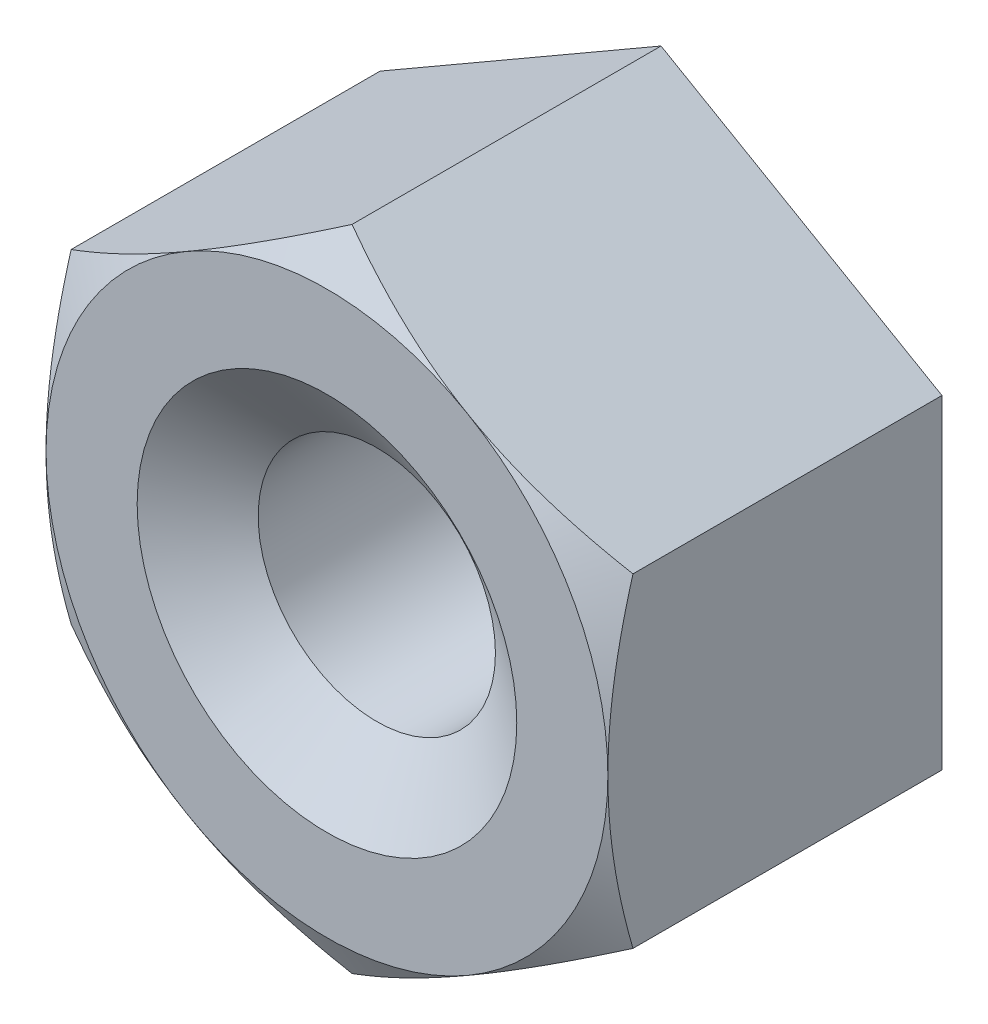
ISO-10303-21;
HEADER;
FILE_DESCRIPTION(('STEP AP214'),'2;1');
FILE_NAME('part.step','',(''),(''),'','','');
FILE_SCHEMA(('AUTOMOTIVE_DESIGN { 1 0 10303 214 1 1 1 1 }'));
ENDSEC;
DATA;
#1=APPLICATION_CONTEXT('core data for automotive mechanical design processes');
#2=APPLICATION_PROTOCOL_DEFINITION('international standard','automotive_design',2000,#1);
#3=PRODUCT_CONTEXT('',#1,'mechanical');
#4=PRODUCT('Part','Part','',(#3));
#5=PRODUCT_RELATED_PRODUCT_CATEGORY('part','',(#4));
#6=PRODUCT_DEFINITION_FORMATION('','',#4);
#7=PRODUCT_DEFINITION_CONTEXT('part definition',#1,'design');
#8=PRODUCT_DEFINITION('design','',#6,#7);
#9=PRODUCT_DEFINITION_SHAPE('','',#8);
#10=(LENGTH_UNIT() NAMED_UNIT(*) SI_UNIT(.MILLI.,.METRE.));
#11=(NAMED_UNIT(*) PLANE_ANGLE_UNIT() SI_UNIT($,.RADIAN.));
#12=(NAMED_UNIT(*) SI_UNIT($,.STERADIAN.) SOLID_ANGLE_UNIT());
#13=UNCERTAINTY_MEASURE_WITH_UNIT(LENGTH_MEASURE(1.E-05),#10,'distance_accuracy_value','');
#14=(GEOMETRIC_REPRESENTATION_CONTEXT(3) GLOBAL_UNCERTAINTY_ASSIGNED_CONTEXT((#13)) GLOBAL_UNIT_ASSIGNED_CONTEXT((#10,
#11,#12)) REPRESENTATION_CONTEXT('',''));
#15=CARTESIAN_POINT('',(0.,0.,0.));
#16=DIRECTION('',(0.,0.,1.));
#17=DIRECTION('',(1.,0.,0.));
#18=AXIS2_PLACEMENT_3D('',#15,#16,#17);
#19=CARTESIAN_POINT('',(0.,0.,-11.176));
#20=DIRECTION('',(0.,0.,1.));
#21=DIRECTION('',(1.,0.,0.));
#22=AXIS2_PLACEMENT_3D('',#19,#20,#21);
#23=CYLINDRICAL_SURFACE('',#22,3.96875);
#24=CARTESIAN_POINT('',(0.,0.,-1.66736920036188));
#25=DIRECTION('',(0.,0.,1.));
#26=DIRECTION('',(1.,0.,0.));
#27=AXIS2_PLACEMENT_3D('',#24,#25,#26);
#28=CIRCLE('',#27,3.96875);
#29=CARTESIAN_POINT('',(3.96875,0.,-1.66736920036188));
#30=VERTEX_POINT('',#29);
#31=EDGE_CURVE('E130',#30,#30,#28,.F.);
#32=ORIENTED_EDGE('',*,*,#31,.F.);
#33=EDGE_LOOP('',(#32));
#34=FACE_BOUND('',#33,.T.);
#35=CARTESIAN_POINT('',(0.,0.,-9.48323079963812));
#36=DIRECTION('',(0.,0.,-1.));
#37=DIRECTION('',(-1.,0.,0.));
#38=AXIS2_PLACEMENT_3D('',#35,#36,#37);
#39=CIRCLE('',#38,3.96875);
#40=CARTESIAN_POINT('',(-3.96875,0.,-9.48323079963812));
#41=VERTEX_POINT('',#40);
#42=EDGE_CURVE('E36',#41,#41,#39,.F.);
#43=ORIENTED_EDGE('',*,*,#42,.F.);
#44=EDGE_LOOP('',(#43));
#45=FACE_BOUND('',#44,.T.);
#46=ADVANCED_FACE('F31',(#34,#45),#23,.F.);
#47=CARTESIAN_POINT('',(-18.796,0.,-11.176));
#48=DIRECTION('',(0.,0.,1.));
#49=DIRECTION('',(1.,0.,0.));
#50=AXIS2_PLACEMENT_3D('',#47,#48,#49);
#51=PLANE('',#50);
#52=DIRECTION('',(-0.866025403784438,-0.500000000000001,0.));
#53=VECTOR('',#52,1.);
#54=CARTESIAN_POINT('',(0.,10.8518756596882,-11.176));
#55=LINE('',#54,#53);
#56=CARTESIAN_POINT('',(0.,10.8518756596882,-11.176));
#57=VERTEX_POINT('',#56);
#58=CARTESIAN_POINT('',(-9.398,5.4259378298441,-11.176));
#59=VERTEX_POINT('',#58);
#60=EDGE_CURVE('E254',#57,#59,#55,.T.);
#61=ORIENTED_EDGE('',*,*,#60,.F.);
#62=DIRECTION('',(-0.866025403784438,0.500000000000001,0.));
#63=VECTOR('',#62,1.);
#64=CARTESIAN_POINT('',(9.398,5.4259378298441,-11.176));
#65=LINE('',#64,#63);
#66=CARTESIAN_POINT('',(9.398,5.4259378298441,-11.176));
#67=VERTEX_POINT('',#66);
#68=EDGE_CURVE('E230',#67,#57,#65,.T.);
#69=ORIENTED_EDGE('',*,*,#68,.F.);
#70=DIRECTION('',(0.,-1.,0.));
#71=VECTOR('',#70,1.);
#72=CARTESIAN_POINT('',(9.398,5.4259378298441,-11.176));
#73=LINE('',#72,#71);
#74=CARTESIAN_POINT('',(9.398,-5.42593782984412,-11.176));
#75=VERTEX_POINT('',#74);
#76=EDGE_CURVE('E243',#67,#75,#73,.T.);
#77=ORIENTED_EDGE('',*,*,#76,.T.);
#78=DIRECTION('',(0.866025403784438,0.500000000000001,0.));
#79=VECTOR('',#78,1.);
#80=CARTESIAN_POINT('',(0.,-10.8518756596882,-11.176));
#81=LINE('',#80,#79);
#82=CARTESIAN_POINT('',(0.,-10.8518756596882,-11.176));
#83=VERTEX_POINT('',#82);
#84=EDGE_CURVE('E245',#83,#75,#81,.T.);
#85=ORIENTED_EDGE('',*,*,#84,.F.);
#86=DIRECTION('',(0.866025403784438,-0.500000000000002,0.));
#87=VECTOR('',#86,1.);
#88=CARTESIAN_POINT('',(-9.398,-5.42593782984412,-11.176));
#89=LINE('',#88,#87);
#90=CARTESIAN_POINT('',(-9.398,-5.42593782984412,-11.176));
#91=VERTEX_POINT('',#90);
#92=EDGE_CURVE('E248',#91,#83,#89,.T.);
#93=ORIENTED_EDGE('',*,*,#92,.F.);
#94=DIRECTION('',(0.,-1.,0.));
#95=VECTOR('',#94,1.);
#96=CARTESIAN_POINT('',(-9.398,5.4259378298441,-11.176));
#97=LINE('',#96,#95);
#98=EDGE_CURVE('E251',#59,#91,#97,.T.);
#99=ORIENTED_EDGE('',*,*,#98,.F.);
#100=EDGE_LOOP('',(#61,#69,#77,#85,#93,#99));
#101=FACE_BOUND('',#100,.T.);
#102=CARTESIAN_POINT('',(0.,0.,-11.176));
#103=DIRECTION('',(0.,0.,1.));
#104=DIRECTION('',(1.,0.,0.));
#105=AXIS2_PLACEMENT_3D('',#102,#103,#104);
#106=CIRCLE('',#105,6.35);
#107=CARTESIAN_POINT('',(6.35,0.,-11.176));
#108=VERTEX_POINT('',#107);
#109=EDGE_CURVE('E215',#108,#108,#106,.F.);
#110=ORIENTED_EDGE('',*,*,#109,.F.);
#111=EDGE_LOOP('',(#110));
#112=FACE_BOUND('',#111,.T.);
#113=ADVANCED_FACE('F201',(#101,#112),#51,.F.);
#114=CARTESIAN_POINT('',(-18.796,0.,0.));
#115=DIRECTION('',(0.,0.,1.));
#116=DIRECTION('',(1.,0.,0.));
#117=AXIS2_PLACEMENT_3D('',#114,#115,#116);
#118=PLANE('',#117);
#119=CARTESIAN_POINT('',(0.,0.,0.));
#120=DIRECTION('',(0.,0.,1.));
#121=DIRECTION('',(1.,0.,0.));
#122=AXIS2_PLACEMENT_3D('',#119,#120,#121);
#123=CIRCLE('',#122,9.398);
#124=CARTESIAN_POINT('',(9.398,0.,0.));
#125=VERTEX_POINT('',#124);
#126=CARTESIAN_POINT('',(4.69900000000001,-8.13890674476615,0.));
#127=VERTEX_POINT('',#126);
#128=EDGE_CURVE('E11',#125,#127,#123,.F.);
#129=ORIENTED_EDGE('',*,*,#128,.F.);
#130=CARTESIAN_POINT('',(0.,0.,0.));
#131=DIRECTION('',(0.,0.,1.));
#132=DIRECTION('',(1.,0.,0.));
#133=AXIS2_PLACEMENT_3D('',#130,#131,#132);
#134=CIRCLE('',#133,9.398);
#135=CARTESIAN_POINT('',(4.69900000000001,8.13890674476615,0.));
#136=VERTEX_POINT('',#135);
#137=EDGE_CURVE('E122',#125,#136,#134,.T.);
#138=ORIENTED_EDGE('',*,*,#137,.T.);
#139=CARTESIAN_POINT('',(-4.69900000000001,8.13890674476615,0.));
#140=VERTEX_POINT('',#139);
#141=EDGE_CURVE('E43',#140,#136,#123,.F.);
#142=ORIENTED_EDGE('',*,*,#141,.F.);
#143=CARTESIAN_POINT('',(-9.398,0.,0.));
#144=VERTEX_POINT('',#143);
#145=EDGE_CURVE('E282',#144,#140,#123,.F.);
#146=ORIENTED_EDGE('',*,*,#145,.F.);
#147=CARTESIAN_POINT('',(-4.69900000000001,-8.13890674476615,0.));
#148=VERTEX_POINT('',#147);
#149=EDGE_CURVE('E280',#148,#144,#123,.F.);
#150=ORIENTED_EDGE('',*,*,#149,.F.);
#151=EDGE_CURVE('E41',#127,#148,#123,.F.);
#152=ORIENTED_EDGE('',*,*,#151,.F.);
#153=EDGE_LOOP('',(#129,#138,#142,#146,#150,#152));
#154=FACE_BOUND('',#153,.T.);
#155=CARTESIAN_POINT('',(0.,0.,0.));
#156=DIRECTION('',(0.,0.,1.));
#157=DIRECTION('',(1.,0.,0.));
#158=AXIS2_PLACEMENT_3D('',#155,#156,#157);
#159=CIRCLE('',#158,6.35);
#160=CARTESIAN_POINT('',(6.35,0.,0.));
#161=VERTEX_POINT('',#160);
#162=EDGE_CURVE('E214',#161,#161,#159,.T.);
#163=ORIENTED_EDGE('',*,*,#162,.F.);
#164=EDGE_LOOP('',(#163));
#165=FACE_BOUND('',#164,.T.);
#166=ADVANCED_FACE('F132',(#154,#165),#118,.T.);
#167=CARTESIAN_POINT('',(0.,10.8518756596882,-11.176));
#168=DIRECTION('',(-0.500000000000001,0.866025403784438,0.));
#169=DIRECTION('',(-0.866025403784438,-0.500000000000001,0.));
#170=AXIS2_PLACEMENT_3D('',#167,#168,#169);
#171=PLANE('',#170);
#172=DIRECTION('',(0.,0.,1.));
#173=VECTOR('',#172,1.);
#174=CARTESIAN_POINT('',(-9.398,5.4259378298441,-11.176));
#175=LINE('',#174,#173);
#176=CARTESIAN_POINT('',(-9.398,5.4259378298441,-0.839395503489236));
#177=VERTEX_POINT('',#176);
#178=EDGE_CURVE('E226',#59,#177,#175,.T.);
#179=ORIENTED_EDGE('',*,*,#178,.T.);
#180=CARTESIAN_POINT('',(-9.3982,5.42582235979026,-0.839462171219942));
#181=CARTESIAN_POINT('',(-9.19161139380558,5.54509634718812,-0.770610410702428));
#182=CARTESIAN_POINT('',(-8.98425251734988,5.66481505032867,-0.704883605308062));
#183=CARTESIAN_POINT('',(-8.56787189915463,5.90521251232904,-0.58054698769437));
#184=CARTESIAN_POINT('',(-8.35884963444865,6.02589157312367,-0.5219395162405));
#185=CARTESIAN_POINT('',(-7.72841485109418,6.38987326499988,-0.357930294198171));
#186=CARTESIAN_POINT('',(-7.30451360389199,6.63461276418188,-0.264642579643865));
#187=CARTESIAN_POINT('',(-6.67016479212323,7.00085422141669,-0.155253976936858));
#188=CARTESIAN_POINT('',(-6.46161239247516,7.12126200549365,-0.124093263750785));
#189=CARTESIAN_POINT('',(-6.0435420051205,7.36263505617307,-0.0718387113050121));
#190=CARTESIAN_POINT('',(-5.83402399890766,7.48360033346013,-0.0507450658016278));
#191=CARTESIAN_POINT('',(-5.41463849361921,7.72573266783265,-0.0191651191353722));
#192=CARTESIAN_POINT('',(-5.20477170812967,7.84689931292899,-0.00866621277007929));
#193=CARTESIAN_POINT('',(-4.78484428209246,8.08934452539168,0.00150116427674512));
#194=CARTESIAN_POINT('',(-4.57478364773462,8.21062308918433,0.00116996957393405));
#195=CARTESIAN_POINT('',(-4.18206997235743,8.4373564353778,-0.00956943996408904));
#196=CARTESIAN_POINT('',(-3.99938921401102,8.54282722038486,-0.0186675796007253));
#197=CARTESIAN_POINT('',(-3.63445494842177,8.75352211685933,-0.0448782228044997));
#198=CARTESIAN_POINT('',(-3.45220147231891,8.85874621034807,-0.0619912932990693));
#199=CARTESIAN_POINT('',(-2.90614723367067,9.17401077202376,-0.124948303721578));
#200=CARTESIAN_POINT('',(-2.54331302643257,9.38349319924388,-0.182402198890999));
#201=CARTESIAN_POINT('',(-1.8137958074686,9.8046801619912,-0.326037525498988));
#202=CARTESIAN_POINT('',(-1.44720589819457,10.0163309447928,-0.412827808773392));
#203=CARTESIAN_POINT('',(-0.719492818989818,10.4364762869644,-0.609805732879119));
#204=CARTESIAN_POINT('',(-0.358360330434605,10.6449762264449,-0.719947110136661));
#205=CARTESIAN_POINT('',(0.000199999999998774,10.851991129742,-0.839462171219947));
#206=B_SPLINE_CURVE_WITH_KNOTS('',3,(#180,#181,#182,#183,#184,#185,#186,#187,#188,#189,#190,
#191,#192,#193,#194,#195,#196,#197,#198,#199,#200,#201,#202,#203,#204,#205),.UNSPECIFIED.,.F.,
.F.,(4,2,2,2,2,2,2,2,2,2,2,2,4),(0.,0.744797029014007,1.48983828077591,2.98309243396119,
3.71139266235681,4.43970690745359,5.16715360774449,5.89457783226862,6.52783305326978,
7.16113307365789,8.42863307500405,9.72424330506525,11.0173102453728),.UNSPECIFIED.);
#207=EDGE_CURVE('E116',#177,#140,#206,.T.);
#208=ORIENTED_EDGE('',*,*,#207,.T.);
#209=CARTESIAN_POINT('',(0.,10.8518756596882,-0.839395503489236));
#210=VERTEX_POINT('',#209);
#211=EDGE_CURVE('E143',#140,#210,#206,.T.);
#212=ORIENTED_EDGE('',*,*,#211,.T.);
#213=DIRECTION('',(0.,0.,1.));
#214=VECTOR('',#213,1.);
#215=CARTESIAN_POINT('',(0.,10.8518756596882,-11.176));
#216=LINE('',#215,#214);
#217=EDGE_CURVE('E238',#57,#210,#216,.T.);
#218=ORIENTED_EDGE('',*,*,#217,.F.);
#219=ORIENTED_EDGE('',*,*,#60,.T.);
#220=EDGE_LOOP('',(#179,#208,#212,#218,#219));
#221=FACE_BOUND('',#220,.T.);
#222=ADVANCED_FACE('F33',(#221),#171,.T.);
#223=CARTESIAN_POINT('',(9.398,5.4259378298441,-11.176));
#224=DIRECTION('',(0.500000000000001,0.866025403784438,0.));
#225=DIRECTION('',(-0.866025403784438,0.500000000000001,0.));
#226=AXIS2_PLACEMENT_3D('',#223,#224,#225);
#227=PLANE('',#226);
#228=ORIENTED_EDGE('',*,*,#217,.T.);
#229=CARTESIAN_POINT('',(-0.000200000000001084,10.851991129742,-0.839462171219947));
#230=CARTESIAN_POINT('',(0.20638860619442,10.7327171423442,-0.770610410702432));
#231=CARTESIAN_POINT('',(0.413747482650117,10.6129984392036,-0.704883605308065));
#232=CARTESIAN_POINT('',(0.830128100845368,10.3726009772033,-0.580546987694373));
#233=CARTESIAN_POINT('',(1.03915036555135,10.2519219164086,-0.521939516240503));
#234=CARTESIAN_POINT('',(1.66958514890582,9.88794022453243,-0.357930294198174));
#235=CARTESIAN_POINT('',(2.09348639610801,9.64320072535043,-0.264642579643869));
#236=CARTESIAN_POINT('',(2.72783520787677,9.27695926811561,-0.15525397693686));
#237=CARTESIAN_POINT('',(2.93638760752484,9.15655148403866,-0.124093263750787));
#238=CARTESIAN_POINT('',(3.3544579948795,8.91517843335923,-0.071838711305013));
#239=CARTESIAN_POINT('',(3.56397600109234,8.79421315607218,-0.0507450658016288));
#240=CARTESIAN_POINT('',(3.9833615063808,8.55208082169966,-0.0191651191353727));
#241=CARTESIAN_POINT('',(4.19322829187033,8.43091417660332,-0.00866621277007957));
#242=CARTESIAN_POINT('',(4.61315571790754,8.18846896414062,0.0015011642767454));
#243=CARTESIAN_POINT('',(4.82321635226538,8.06719040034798,0.00116996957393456));
#244=CARTESIAN_POINT('',(5.21593002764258,7.84045705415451,-0.00956943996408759));
#245=CARTESIAN_POINT('',(5.39861078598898,7.73498626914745,-0.0186675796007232));
#246=CARTESIAN_POINT('',(5.76354505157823,7.52429137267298,-0.0448782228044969));
#247=CARTESIAN_POINT('',(5.94579852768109,7.41906727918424,-0.0619912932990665));
#248=CARTESIAN_POINT('',(6.49185276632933,7.10380271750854,-0.124948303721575));
#249=CARTESIAN_POINT('',(6.85468697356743,6.89432029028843,-0.182402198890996));
#250=CARTESIAN_POINT('',(7.5842041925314,6.47313332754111,-0.326037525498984));
#251=CARTESIAN_POINT('',(7.95079410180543,6.26148254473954,-0.412827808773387));
#252=CARTESIAN_POINT('',(8.67850718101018,5.84133720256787,-0.609805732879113));
#253=CARTESIAN_POINT('',(9.03963966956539,5.6328372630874,-0.719947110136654));
#254=CARTESIAN_POINT('',(9.3982,5.42582235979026,-0.839462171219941));
#255=B_SPLINE_CURVE_WITH_KNOTS('',3,(#229,#230,#231,#232,#233,#234,#235,#236,#237,#238,#239,
#240,#241,#242,#243,#244,#245,#246,#247,#248,#249,#250,#251,#252,#253,#254),.UNSPECIFIED.,.F.,
.F.,(4,2,2,2,2,2,2,2,2,2,2,2,4),(0.,0.744797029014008,1.48983828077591,2.98309243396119,
3.71139266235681,4.43970690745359,5.1671536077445,5.89457783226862,6.52783305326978,
7.16113307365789,8.42863307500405,9.72424330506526,11.0173102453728),.UNSPECIFIED.);
#256=EDGE_CURVE('E139',#210,#136,#255,.T.);
#257=ORIENTED_EDGE('',*,*,#256,.T.);
#258=CARTESIAN_POINT('',(9.398,5.42593782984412,-0.839395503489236));
#259=VERTEX_POINT('',#258);
#260=EDGE_CURVE('E125',#136,#259,#255,.T.);
#261=ORIENTED_EDGE('',*,*,#260,.T.);
#262=DIRECTION('',(0.,0.,1.));
#263=VECTOR('',#262,1.);
#264=CARTESIAN_POINT('',(9.398,5.4259378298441,-11.176));
#265=LINE('',#264,#263);
#266=EDGE_CURVE('E138',#67,#259,#265,.T.);
#267=ORIENTED_EDGE('',*,*,#266,.F.);
#268=ORIENTED_EDGE('',*,*,#68,.T.);
#269=EDGE_LOOP('',(#228,#257,#261,#267,#268));
#270=FACE_BOUND('',#269,.T.);
#271=ADVANCED_FACE('F259',(#270),#227,.T.);
#272=CARTESIAN_POINT('',(9.398,5.4259378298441,-11.176));
#273=DIRECTION('',(-1.,0.,0.));
#274=DIRECTION('',(0.,-1.,0.));
#275=AXIS2_PLACEMENT_3D('',#272,#273,#274);
#276=PLANE('',#275);
#277=CARTESIAN_POINT('',(9.39799999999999,-14.3903867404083,-4.49719397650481));
#278=CARTESIAN_POINT('',(9.39799999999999,-14.1840817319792,-4.39746919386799));
#279=CARTESIAN_POINT('',(9.39799999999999,-13.9775273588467,-4.29826053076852));
#280=CARTESIAN_POINT('',(9.39799999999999,-13.5638672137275,-4.10099391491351));
#281=CARTESIAN_POINT('',(9.39799999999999,-13.3567614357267,-4.00293597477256));
#282=CARTESIAN_POINT('',(9.39799999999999,-12.7344773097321,-3.71063752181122));
#283=CARTESIAN_POINT('',(9.39799999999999,-12.3183992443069,-3.51830489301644));
#284=CARTESIAN_POINT('',(9.39799999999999,-11.4809868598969,-3.13886846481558));
#285=CARTESIAN_POINT('',(9.398,-11.0596360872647,-2.95180088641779));
#286=CARTESIAN_POINT('',(9.398,-10.2134721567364,-2.58569755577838));
#287=CARTESIAN_POINT('',(9.398,-9.78865918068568,-2.40666138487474));
#288=CARTESIAN_POINT('',(9.398,-8.92962024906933,-2.05663610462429));
#289=CARTESIAN_POINT('',(9.398,-8.49534276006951,-1.88577277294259));
#290=CARTESIAN_POINT('',(9.398,-7.62166664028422,-1.55742773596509));
#291=CARTESIAN_POINT('',(9.398,-7.18226744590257,-1.3999475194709));
#292=CARTESIAN_POINT('',(9.398,-6.29854584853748,-1.10260108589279));
#293=CARTESIAN_POINT('',(9.398,-5.85423618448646,-0.962697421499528));
#294=CARTESIAN_POINT('',(9.398,-4.95931637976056,-0.705045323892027));
#295=CARTESIAN_POINT('',(9.398,-4.50870828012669,-0.587289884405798));
#296=CARTESIAN_POINT('',(9.398,-3.60080852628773,-0.379659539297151));
#297=CARTESIAN_POINT('',(9.398,-3.14351512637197,-0.2897920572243));
#298=CARTESIAN_POINT('',(9.398,-2.45355101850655,-0.18040654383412));
#299=CARTESIAN_POINT('',(9.398,-2.2228640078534,-0.148178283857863));
#300=CARTESIAN_POINT('',(9.398,-1.76040842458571,-0.0928277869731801));
#301=CARTESIAN_POINT('',(9.398,-1.52863996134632,-0.069704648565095));
#302=CARTESIAN_POINT('',(9.398,-1.06580500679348,-0.0331866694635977));
#303=CARTESIAN_POINT('',(9.398,-0.834743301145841,-0.0197314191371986));
#304=CARTESIAN_POINT('',(9.398,-0.372257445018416,-0.00262035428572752));
#305=CARTESIAN_POINT('',(9.398,-0.14083329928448,0.0010355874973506));
#306=CARTESIAN_POINT('',(9.398,0.321895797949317,-0.00153907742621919));
#307=CARTESIAN_POINT('',(9.398,0.553200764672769,-0.0077669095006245));
#308=CARTESIAN_POINT('',(9.398,1.01534659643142,-0.0299542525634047));
#309=CARTESIAN_POINT('',(9.398,1.24618743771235,-0.0459142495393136));
#310=CARTESIAN_POINT('',(9.398,1.80567456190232,-0.0960575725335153));
#311=CARTESIAN_POINT('',(9.398,2.13389098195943,-0.135117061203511));
#312=CARTESIAN_POINT('',(9.398,2.78780872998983,-0.230742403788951));
#313=CARTESIAN_POINT('',(9.398,3.1135093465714,-0.287313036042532));
#314=CARTESIAN_POINT('',(9.398,3.76212678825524,-0.415954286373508));
#315=CARTESIAN_POINT('',(9.398,4.0850406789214,-0.488039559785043));
#316=CARTESIAN_POINT('',(9.398,4.72754613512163,-0.645510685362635));
#317=CARTESIAN_POINT('',(9.398,5.04713801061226,-0.730895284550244));
#318=CARTESIAN_POINT('',(9.398,5.6908709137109,-0.915154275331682));
#319=CARTESIAN_POINT('',(9.398,6.01493142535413,-1.01430802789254));
#320=CARTESIAN_POINT('',(9.398,6.65962712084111,-1.22241249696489));
#321=CARTESIAN_POINT('',(9.398,6.980264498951,-1.33135645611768));
#322=CARTESIAN_POINT('',(9.398,7.61682732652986,-1.55679099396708));
#323=CARTESIAN_POINT('',(9.398,7.93276913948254,-1.67323564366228));
#324=CARTESIAN_POINT('',(9.398,8.5622014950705,-1.91295958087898));
#325=CARTESIAN_POINT('',(9.398,8.87569098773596,-2.0362416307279));
#326=CARTESIAN_POINT('',(9.398,9.18804160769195,-2.16226601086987));
#327=B_SPLINE_CURVE_WITH_KNOTS('',3,(#277,#278,#279,#280,#281,#282,#283,#284,#285,#286,#287,
#288,#289,#290,#291,#292,#293,#294,#295,#296,#297,#298,#299,#300,#301,#302,#303,#304,#305,#306,
#307,#308,#309,#310,#311,#312,#313,#314,#315,#316,#317,#318,#319,#320,#321,#322,#323,#324,#325,
#326),.UNSPECIFIED.,.F.,.F.,(4,2,2,2,2,2,2,2,2,2,2,2,2,2,2,2,2,2,2,2,2,2,2,2,4),(0.,
0.687429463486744,1.37486645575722,2.74996404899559,4.13293077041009,5.51582531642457,
6.91569751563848,8.31572524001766,9.71271767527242,11.1092674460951,12.5061886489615,
13.2048192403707,13.9033806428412,14.5975382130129,15.2916867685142,15.9856404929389,
16.679628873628,17.6706737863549,18.6619893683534,19.654245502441,20.6464082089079,
21.6628909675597,22.6786774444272,23.6887463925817,24.6992264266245),.UNSPECIFIED.);
#328=CARTESIAN_POINT('',(9.398,-5.42593782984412,-0.839395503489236));
#329=VERTEX_POINT('',#328);
#330=EDGE_CURVE('E105',#329,#125,#327,.T.);
#331=ORIENTED_EDGE('',*,*,#330,.F.);
#332=DIRECTION('',(0.,0.,1.));
#333=VECTOR('',#332,1.);
#334=CARTESIAN_POINT('',(9.398,-5.42593782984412,-11.176));
#335=LINE('',#334,#333);
#336=EDGE_CURVE('E235',#75,#329,#335,.T.);
#337=ORIENTED_EDGE('',*,*,#336,.F.);
#338=ORIENTED_EDGE('',*,*,#76,.F.);
#339=ORIENTED_EDGE('',*,*,#266,.T.);
#340=EDGE_CURVE('E118',#125,#259,#327,.T.);
#341=ORIENTED_EDGE('',*,*,#340,.F.);
#342=EDGE_LOOP('',(#331,#337,#338,#339,#341));
#343=FACE_BOUND('',#342,.T.);
#344=ADVANCED_FACE('F136',(#343),#276,.F.);
#345=CARTESIAN_POINT('',(0.,-10.8518756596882,-11.176));
#346=DIRECTION('',(0.500000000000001,-0.866025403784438,0.));
#347=DIRECTION('',(0.866025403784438,0.500000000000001,0.));
#348=AXIS2_PLACEMENT_3D('',#345,#346,#347);
#349=PLANE('',#348);
#350=ORIENTED_EDGE('',*,*,#336,.T.);
#351=CARTESIAN_POINT('',(9.3982,-5.42582235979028,-0.839462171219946));
#352=CARTESIAN_POINT('',(9.19161139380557,-5.54509634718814,-0.770610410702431));
#353=CARTESIAN_POINT('',(8.98425251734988,-5.66481505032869,-0.704883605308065));
#354=CARTESIAN_POINT('',(8.56787189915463,-5.90521251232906,-0.580546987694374));
#355=CARTESIAN_POINT('',(8.35884963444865,-6.02589157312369,-0.521939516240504));
#356=CARTESIAN_POINT('',(7.72841485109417,-6.3898732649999,-0.357930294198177));
#357=CARTESIAN_POINT('',(7.30451360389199,-6.6346127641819,-0.264642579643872));
#358=CARTESIAN_POINT('',(6.67016479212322,-7.00085422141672,-0.155253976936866));
#359=CARTESIAN_POINT('',(6.46161239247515,-7.12126200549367,-0.124093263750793));
#360=CARTESIAN_POINT('',(6.04354200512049,-7.3626350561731,-0.0718387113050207));
#361=CARTESIAN_POINT('',(5.83402399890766,-7.48360033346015,-0.0507450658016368));
#362=CARTESIAN_POINT('',(5.4146384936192,-7.72573266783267,-0.0191651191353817));
#363=CARTESIAN_POINT('',(5.20477170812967,-7.84689931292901,-0.00866621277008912));
#364=CARTESIAN_POINT('',(4.78484428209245,-8.08934452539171,0.00150116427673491));
#365=CARTESIAN_POINT('',(4.57478364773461,-8.21062308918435,0.00116996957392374));
#366=CARTESIAN_POINT('',(4.18206997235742,-8.43735643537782,-0.0095694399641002));
#367=CARTESIAN_POINT('',(3.99938921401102,-8.54282722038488,-0.0186675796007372));
#368=CARTESIAN_POINT('',(3.63445494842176,-8.75352211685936,-0.0448782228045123));
#369=CARTESIAN_POINT('',(3.4522014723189,-8.85874621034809,-0.0619912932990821));
#370=CARTESIAN_POINT('',(2.90614723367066,-9.17401077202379,-0.124948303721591));
#371=CARTESIAN_POINT('',(2.54331302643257,-9.38349319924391,-0.182402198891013));
#372=CARTESIAN_POINT('',(1.8137958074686,-9.80468016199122,-0.326037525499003));
#373=CARTESIAN_POINT('',(1.44720589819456,-10.0163309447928,-0.412827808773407));
#374=CARTESIAN_POINT('',(0.719492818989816,-10.4364762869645,-0.609805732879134));
#375=CARTESIAN_POINT('',(0.358360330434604,-10.6449762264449,-0.719947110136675));
#376=CARTESIAN_POINT('',(-0.000200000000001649,-10.8519911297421,-0.839462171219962));
#377=B_SPLINE_CURVE_WITH_KNOTS('',3,(#351,#352,#353,#354,#355,#356,#357,#358,#359,#360,#361,
#362,#363,#364,#365,#366,#367,#368,#369,#370,#371,#372,#373,#374,#375,#376),.UNSPECIFIED.,.F.,
.F.,(4,2,2,2,2,2,2,2,2,2,2,2,4),(0.,0.744797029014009,1.48983828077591,2.98309243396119,
3.71139266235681,4.43970690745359,5.1671536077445,5.89457783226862,6.52783305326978,
7.16113307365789,8.42863307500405,9.72424330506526,11.0173102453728),.UNSPECIFIED.);
#378=EDGE_CURVE('E111',#329,#127,#377,.T.);
#379=ORIENTED_EDGE('',*,*,#378,.T.);
#380=CARTESIAN_POINT('',(0.,-10.8518756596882,-0.839395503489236));
#381=VERTEX_POINT('',#380);
#382=EDGE_CURVE('E50',#127,#381,#377,.T.);
#383=ORIENTED_EDGE('',*,*,#382,.T.);
#384=DIRECTION('',(0.,0.,1.));
#385=VECTOR('',#384,1.);
#386=CARTESIAN_POINT('',(0.,-10.8518756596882,-11.176));
#387=LINE('',#386,#385);
#388=EDGE_CURVE('E232',#83,#381,#387,.T.);
#389=ORIENTED_EDGE('',*,*,#388,.F.);
#390=ORIENTED_EDGE('',*,*,#84,.T.);
#391=EDGE_LOOP('',(#350,#379,#383,#389,#390));
#392=FACE_BOUND('',#391,.T.);
#393=ADVANCED_FACE('F190',(#392),#349,.T.);
#394=CARTESIAN_POINT('',(-9.398,-5.42593782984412,-11.176));
#395=DIRECTION('',(-0.500000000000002,-0.866025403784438,0.));
#396=DIRECTION('',(0.866025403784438,-0.500000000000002,0.));
#397=AXIS2_PLACEMENT_3D('',#394,#395,#396);
#398=PLANE('',#397);
#399=ORIENTED_EDGE('',*,*,#388,.T.);
#400=CARTESIAN_POINT('',(0.000199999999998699,-10.8519911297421,-0.839462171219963));
#401=CARTESIAN_POINT('',(-0.206388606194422,-10.7327171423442,-0.770610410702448));
#402=CARTESIAN_POINT('',(-0.413747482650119,-10.6129984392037,-0.704883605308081));
#403=CARTESIAN_POINT('',(-0.830128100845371,-10.3726009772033,-0.580546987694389));
#404=CARTESIAN_POINT('',(-1.03915036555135,-10.2519219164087,-0.521939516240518));
#405=CARTESIAN_POINT('',(-1.66958514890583,-9.88794022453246,-0.357930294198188));
#406=CARTESIAN_POINT('',(-2.09348639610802,-9.64320072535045,-0.264642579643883));
#407=CARTESIAN_POINT('',(-2.72783520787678,-9.27695926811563,-0.155253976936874));
#408=CARTESIAN_POINT('',(-2.93638760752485,-9.15655148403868,-0.1240932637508));
#409=CARTESIAN_POINT('',(-3.35445799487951,-8.91517843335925,-0.0718387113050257));
#410=CARTESIAN_POINT('',(-3.56397600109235,-8.7942131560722,-0.0507450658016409));
#411=CARTESIAN_POINT('',(-3.9833615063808,-8.55208082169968,-0.0191651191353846));
#412=CARTESIAN_POINT('',(-4.19322829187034,-8.43091417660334,-0.00866621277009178));
#413=CARTESIAN_POINT('',(-4.61315571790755,-8.18846896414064,0.00150116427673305));
#414=CARTESIAN_POINT('',(-4.8232163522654,-8.067190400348,0.00116996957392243));
#415=CARTESIAN_POINT('',(-5.21593002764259,-7.84045705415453,-0.00956943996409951));
#416=CARTESIAN_POINT('',(-5.39861078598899,-7.73498626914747,-0.0186675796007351));
#417=CARTESIAN_POINT('',(-5.76354505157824,-7.52429137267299,-0.0448782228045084));
#418=CARTESIAN_POINT('',(-5.9457985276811,-7.41906727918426,-0.0619912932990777));
#419=CARTESIAN_POINT('',(-6.49185276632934,-7.10380271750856,-0.124948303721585));
#420=CARTESIAN_POINT('',(-6.85468697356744,-6.89432029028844,-0.182402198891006));
#421=CARTESIAN_POINT('',(-7.5842041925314,-6.47313332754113,-0.326037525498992));
#422=CARTESIAN_POINT('',(-7.95079410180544,-6.26148254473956,-0.412827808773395));
#423=CARTESIAN_POINT('',(-8.67850718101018,-5.84133720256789,-0.60980573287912));
#424=CARTESIAN_POINT('',(-9.03963966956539,-5.63283726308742,-0.719947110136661));
#425=CARTESIAN_POINT('',(-9.3982,-5.42582235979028,-0.839462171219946));
#426=B_SPLINE_CURVE_WITH_KNOTS('',3,(#400,#401,#402,#403,#404,#405,#406,#407,#408,#409,#410,
#411,#412,#413,#414,#415,#416,#417,#418,#419,#420,#421,#422,#423,#424,#425),.UNSPECIFIED.,.F.,
.F.,(4,2,2,2,2,2,2,2,2,2,2,2,4),(0.,0.744797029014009,1.48983828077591,2.9830924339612,
3.71139266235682,4.4397069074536,5.16715360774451,5.89457783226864,6.5278330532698,
7.16113307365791,8.42863307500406,9.72424330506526,11.0173102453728),.UNSPECIFIED.);
#427=EDGE_CURVE('E184',#381,#148,#426,.T.);
#428=ORIENTED_EDGE('',*,*,#427,.T.);
#429=CARTESIAN_POINT('',(-9.398,-5.42593782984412,-0.839395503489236));
#430=VERTEX_POINT('',#429);
#431=EDGE_CURVE('E57',#148,#430,#426,.T.);
#432=ORIENTED_EDGE('',*,*,#431,.T.);
#433=DIRECTION('',(0.,0.,1.));
#434=VECTOR('',#433,1.);
#435=CARTESIAN_POINT('',(-9.398,-5.42593782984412,-11.176));
#436=LINE('',#435,#434);
#437=EDGE_CURVE('E229',#91,#430,#436,.T.);
#438=ORIENTED_EDGE('',*,*,#437,.F.);
#439=ORIENTED_EDGE('',*,*,#92,.T.);
#440=EDGE_LOOP('',(#399,#428,#432,#438,#439));
#441=FACE_BOUND('',#440,.T.);
#442=ADVANCED_FACE('F186',(#441),#398,.T.);
#443=CARTESIAN_POINT('',(-9.398,5.4259378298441,-11.176));
#444=DIRECTION('',(-1.,0.,0.));
#445=DIRECTION('',(0.,-1.,0.));
#446=AXIS2_PLACEMENT_3D('',#443,#444,#445);
#447=PLANE('',#446);
#448=ORIENTED_EDGE('',*,*,#437,.T.);
#449=CARTESIAN_POINT('',(-9.398,-14.3903867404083,-4.49719397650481));
#450=CARTESIAN_POINT('',(-9.398,-14.1840817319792,-4.39746919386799));
#451=CARTESIAN_POINT('',(-9.398,-13.9775273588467,-4.29826053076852));
#452=CARTESIAN_POINT('',(-9.398,-13.5638672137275,-4.10099391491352));
#453=CARTESIAN_POINT('',(-9.398,-13.3567614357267,-4.00293597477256));
#454=CARTESIAN_POINT('',(-9.398,-12.7344773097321,-3.71063752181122));
#455=CARTESIAN_POINT('',(-9.398,-12.3183992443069,-3.51830489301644));
#456=CARTESIAN_POINT('',(-9.398,-11.4809868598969,-3.13886846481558));
#457=CARTESIAN_POINT('',(-9.398,-11.0596360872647,-2.9518008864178));
#458=CARTESIAN_POINT('',(-9.398,-10.2134721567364,-2.58569755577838));
#459=CARTESIAN_POINT('',(-9.398,-9.78865918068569,-2.40666138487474));
#460=CARTESIAN_POINT('',(-9.398,-8.92962024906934,-2.0566361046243));
#461=CARTESIAN_POINT('',(-9.398,-8.49534276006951,-1.88577277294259));
#462=CARTESIAN_POINT('',(-9.398,-7.62166664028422,-1.55742773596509));
#463=CARTESIAN_POINT('',(-9.398,-7.18226744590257,-1.3999475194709));
#464=CARTESIAN_POINT('',(-9.398,-6.29854584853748,-1.10260108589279));
#465=CARTESIAN_POINT('',(-9.398,-5.85423618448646,-0.962697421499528));
#466=CARTESIAN_POINT('',(-9.398,-4.95931637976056,-0.705045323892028));
#467=CARTESIAN_POINT('',(-9.398,-4.50870828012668,-0.587289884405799));
#468=CARTESIAN_POINT('',(-9.398,-3.60080852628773,-0.379659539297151));
#469=CARTESIAN_POINT('',(-9.398,-3.14351512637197,-0.2897920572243));
#470=CARTESIAN_POINT('',(-9.398,-2.45355101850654,-0.180406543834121));
#471=CARTESIAN_POINT('',(-9.398,-2.22286400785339,-0.148178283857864));
#472=CARTESIAN_POINT('',(-9.398,-1.76040842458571,-0.0928277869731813));
#473=CARTESIAN_POINT('',(-9.398,-1.52863996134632,-0.069704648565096));
#474=CARTESIAN_POINT('',(-9.398,-1.06580500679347,-0.0331866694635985));
#475=CARTESIAN_POINT('',(-9.398,-0.834743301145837,-0.0197314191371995));
#476=CARTESIAN_POINT('',(-9.398,-0.372257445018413,-0.00262035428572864));
#477=CARTESIAN_POINT('',(-9.398,-0.140833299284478,0.00103558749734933));
#478=CARTESIAN_POINT('',(-9.398,0.321895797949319,-0.00153907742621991));
#479=CARTESIAN_POINT('',(-9.398,0.553200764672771,-0.00776690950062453));
#480=CARTESIAN_POINT('',(-9.398,1.01534659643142,-0.0299542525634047));
#481=CARTESIAN_POINT('',(-9.398,1.24618743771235,-0.0459142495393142));
#482=CARTESIAN_POINT('',(-9.398,1.80567456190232,-0.0960575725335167));
#483=CARTESIAN_POINT('',(-9.398,2.13389098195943,-0.135117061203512));
#484=CARTESIAN_POINT('',(-9.398,2.78780872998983,-0.230742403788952));
#485=CARTESIAN_POINT('',(-9.398,3.1135093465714,-0.287313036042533));
#486=CARTESIAN_POINT('',(-9.398,3.76212678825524,-0.415954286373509));
#487=CARTESIAN_POINT('',(-9.398,4.0850406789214,-0.488039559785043));
#488=CARTESIAN_POINT('',(-9.398,4.72754613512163,-0.645510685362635));
#489=CARTESIAN_POINT('',(-9.398,5.04713801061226,-0.730895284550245));
#490=CARTESIAN_POINT('',(-9.398,5.6908709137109,-0.915154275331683));
#491=CARTESIAN_POINT('',(-9.398,6.01493142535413,-1.01430802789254));
#492=CARTESIAN_POINT('',(-9.398,6.65962712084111,-1.22241249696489));
#493=CARTESIAN_POINT('',(-9.398,6.980264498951,-1.33135645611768));
#494=CARTESIAN_POINT('',(-9.398,7.61682732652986,-1.55679099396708));
#495=CARTESIAN_POINT('',(-9.398,7.93276913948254,-1.67323564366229));
#496=CARTESIAN_POINT('',(-9.398,8.56220149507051,-1.91295958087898));
#497=CARTESIAN_POINT('',(-9.398,8.87569098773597,-2.0362416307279));
#498=CARTESIAN_POINT('',(-9.398,9.18804160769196,-2.16226601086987));
#499=B_SPLINE_CURVE_WITH_KNOTS('',3,(#449,#450,#451,#452,#453,#454,#455,#456,#457,#458,#459,
#460,#461,#462,#463,#464,#465,#466,#467,#468,#469,#470,#471,#472,#473,#474,#475,#476,#477,#478,
#479,#480,#481,#482,#483,#484,#485,#486,#487,#488,#489,#490,#491,#492,#493,#494,#495,#496,#497,
#498),.UNSPECIFIED.,.F.,.F.,(4,2,2,2,2,2,2,2,2,2,2,2,2,2,2,2,2,2,2,2,2,2,2,2,4),(0.,
0.687429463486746,1.37486645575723,2.74996404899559,4.13293077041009,5.51582531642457,
6.91569751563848,8.31572524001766,9.71271767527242,11.1092674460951,12.5061886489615,
13.2048192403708,13.9033806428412,14.5975382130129,15.2916867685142,15.9856404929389,
16.679628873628,17.6706737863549,18.6619893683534,19.6542455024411,20.6464082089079,
21.6628909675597,22.6786774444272,23.6887463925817,24.6992264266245),.UNSPECIFIED.);
#500=EDGE_CURVE('E185',#430,#144,#499,.T.);
#501=ORIENTED_EDGE('',*,*,#500,.T.);
#502=EDGE_CURVE('E129',#144,#177,#499,.T.);
#503=ORIENTED_EDGE('',*,*,#502,.T.);
#504=ORIENTED_EDGE('',*,*,#178,.F.);
#505=ORIENTED_EDGE('',*,*,#98,.T.);
#506=EDGE_LOOP('',(#448,#501,#503,#504,#505));
#507=FACE_BOUND('',#506,.T.);
#508=ADVANCED_FACE('F189',(#507),#447,.T.);
#509=CARTESIAN_POINT('',(0.,0.,0.));
#510=DIRECTION('',(0.,0.,-1.));
#511=DIRECTION('',(-1.,0.,0.));
#512=AXIS2_PLACEMENT_3D('',#509,#510,#511);
#513=CONICAL_SURFACE('',#512,9.398,1.0471975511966);
#514=ORIENTED_EDGE('',*,*,#137,.F.);
#515=ORIENTED_EDGE('',*,*,#340,.T.);
#516=ORIENTED_EDGE('',*,*,#260,.F.);
#517=EDGE_LOOP('',(#514,#515,#516));
#518=FACE_BOUND('',#517,.T.);
#519=ADVANCED_FACE('F123',(#518),#513,.T.);
#520=ORIENTED_EDGE('',*,*,#141,.T.);
#521=ORIENTED_EDGE('',*,*,#256,.F.);
#522=ORIENTED_EDGE('',*,*,#211,.F.);
#523=EDGE_LOOP('',(#520,#521,#522));
#524=FACE_BOUND('',#523,.T.);
#525=ADVANCED_FACE('F167',(#524),#513,.T.);
#526=ORIENTED_EDGE('',*,*,#502,.F.);
#527=ORIENTED_EDGE('',*,*,#145,.T.);
#528=ORIENTED_EDGE('',*,*,#207,.F.);
#529=EDGE_LOOP('',(#526,#527,#528));
#530=FACE_BOUND('',#529,.T.);
#531=ADVANCED_FACE('F166',(#530),#513,.T.);
#532=ORIENTED_EDGE('',*,*,#149,.T.);
#533=ORIENTED_EDGE('',*,*,#500,.F.);
#534=ORIENTED_EDGE('',*,*,#431,.F.);
#535=EDGE_LOOP('',(#532,#533,#534));
#536=FACE_BOUND('',#535,.T.);
#537=ADVANCED_FACE('F160',(#536),#513,.T.);
#538=ORIENTED_EDGE('',*,*,#151,.T.);
#539=ORIENTED_EDGE('',*,*,#427,.F.);
#540=ORIENTED_EDGE('',*,*,#382,.F.);
#541=EDGE_LOOP('',(#538,#539,#540));
#542=FACE_BOUND('',#541,.T.);
#543=ADVANCED_FACE('F165',(#542),#513,.T.);
#544=ORIENTED_EDGE('',*,*,#330,.T.);
#545=ORIENTED_EDGE('',*,*,#128,.T.);
#546=ORIENTED_EDGE('',*,*,#378,.F.);
#547=EDGE_LOOP('',(#544,#545,#546));
#548=FACE_BOUND('',#547,.T.);
#549=ADVANCED_FACE('F107',(#548),#513,.T.);
#550=CARTESIAN_POINT('',(0.,0.,-1.83410612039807));
#551=DIRECTION('',(0.,0.,1.));
#552=DIRECTION('',(1.,0.,0.));
#553=AXIS2_PLACEMENT_3D('',#550,#551,#552);
#554=CONICAL_SURFACE('',#553,3.730625,0.95993108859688);
#555=ORIENTED_EDGE('',*,*,#162,.T.);
#556=EDGE_LOOP('',(#555));
#557=FACE_BOUND('',#556,.T.);
#558=ORIENTED_EDGE('',*,*,#31,.T.);
#559=EDGE_LOOP('',(#558));
#560=FACE_BOUND('',#559,.T.);
#561=ADVANCED_FACE('F168',(#557,#560),#554,.F.);
#562=CARTESIAN_POINT('',(0.,0.,-11.1506));
#563=DIRECTION('',(0.,0.,-1.));
#564=DIRECTION('',(-1.,0.,0.));
#565=AXIS2_PLACEMENT_3D('',#562,#563,#564);
#566=CONICAL_SURFACE('',#565,6.35,0.959931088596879);
#567=CARTESIAN_POINT('',(0.,0.,-11.1506));
#568=DIRECTION('',(0.,0.,1.));
#569=DIRECTION('',(1.,0.,0.));
#570=AXIS2_PLACEMENT_3D('',#567,#568,#569);
#571=CIRCLE('',#570,6.35);
#572=CARTESIAN_POINT('',(6.35,0.,-11.1506));
#573=VERTEX_POINT('',#572);
#574=EDGE_CURVE('E219',#573,#573,#571,.T.);
#575=ORIENTED_EDGE('',*,*,#574,.F.);
#576=EDGE_LOOP('',(#575));
#577=FACE_BOUND('',#576,.T.);
#578=ORIENTED_EDGE('',*,*,#42,.T.);
#579=EDGE_LOOP('',(#578));
#580=FACE_BOUND('',#579,.T.);
#581=ADVANCED_FACE('F378',(#577,#580),#566,.F.);
#582=CARTESIAN_POINT('',(0.,0.,-25.0375057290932));
#583=DIRECTION('',(0.,0.,1.));
#584=DIRECTION('',(1.,0.,0.));
#585=AXIS2_PLACEMENT_3D('',#582,#583,#584);
#586=CYLINDRICAL_SURFACE('',#585,6.35);
#587=ORIENTED_EDGE('',*,*,#574,.T.);
#588=EDGE_LOOP('',(#587));
#589=FACE_BOUND('',#588,.T.);
#590=ORIENTED_EDGE('',*,*,#109,.T.);
#591=EDGE_LOOP('',(#590));
#592=FACE_BOUND('',#591,.T.);
#593=ADVANCED_FACE('F386',(#589,#592),#586,.F.);
#594=CLOSED_SHELL('',(#46,#113,#166,#222,#271,#344,#393,#442,#508,#519,#525,#531,#537,#543,#549,
#561,#581,#593));
#595=MANIFOLD_SOLID_BREP('B2',#594);
#596=ADVANCED_BREP_SHAPE_REPRESENTATION('',(#18,#595),#14);
#597=SHAPE_DEFINITION_REPRESENTATION(#9,#596);
ENDSEC;
END-ISO-10303-21;
